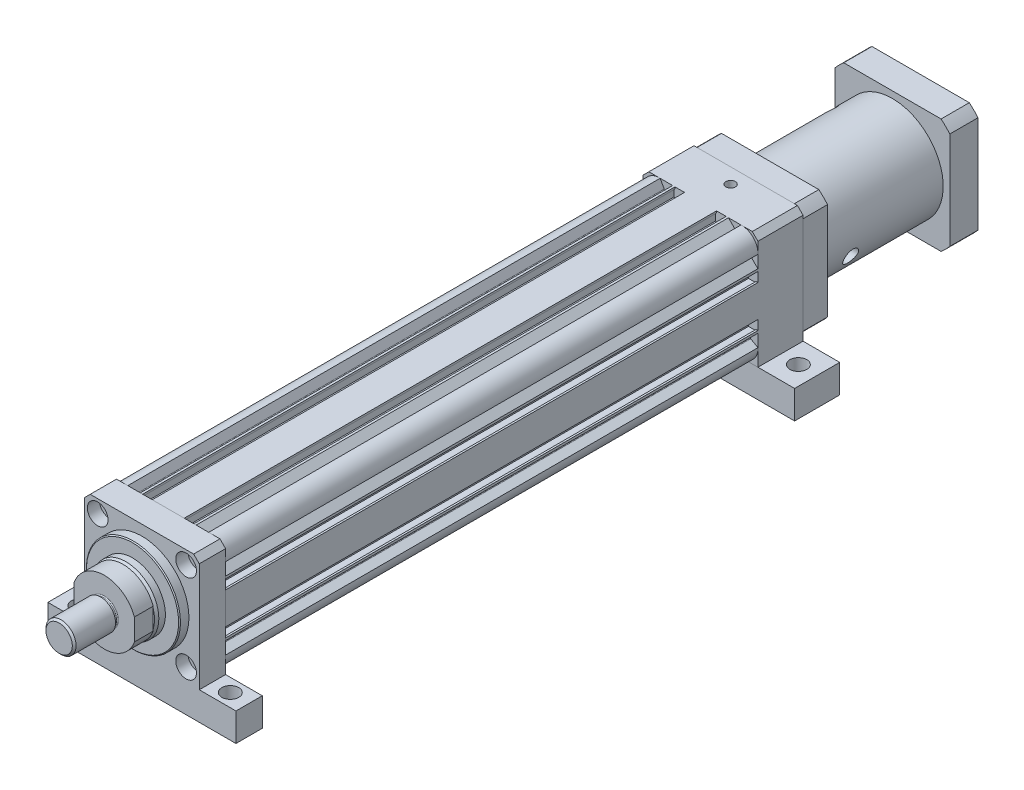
from build123d import *

# Parameters (mm, degrees)
SKETCH_1_R           = 25
SKETCH_1_R_2         = 2.594
EXTRUDE_1_DEPTH      = 283
EXTRUDE_1_2_DEPTH    = 14
SKETCH_3_R           = 4.5
SKETCH_3_R_2         = 3.5
CUT_EXTRUDE_3_DEPTH  = 14
SKETCH_3_5_R         = 5.5
CUT_EXTRUDE_4_DEPTH  = 6.5
SKETCH_5_R           = 25
EXTRUDE_2_DEPTH      = 5
CHAMFER_1_SIZE       = 0.5
SKETCH_6_R           = 17.5
EXTRUDE_3_DEPTH      = 5
CHAMFER_2_SIZE       = 1.5
CHAMFER_2_SIZE2      = 0.8
EXTRUDE_4_DEPTH      = 10
SKETCH_8_R           = 7
EXTRUDE_5_DEPTH      = 2
SKETCH_9_R           = 8
EXTRUDE_6_DEPTH      = 22
CHAMFER_3_SIZE       = 1
FILLET_1_R           = 0.5
SKETCH_10_W          = 61
SKETCH_10_H          = 61
EXTRUDE_7_DEPTH      = 24
SKETCH_16_W          = 61
SKETCH_16_H          = 61
EXTRUDE_8_DEPTH      = 13
SKETCH_18_R          = 3.5
CUT_EXTRUDE_5_DEPTH  = 13
SKETCH_19_R          = 27
EXTRUDE_9_DEPTH      = 65
SKETCH_20_W          = 61
SKETCH_20_H          = 61
EXTRUDE_10_DEPTH     = 15
SKETCH_21_R          = 2.5
CUT_EXTRUDE_6_DEPTH  = 10
SKETCH_22_R          = 50
SKETCH_22_R_2        = 40
CUT_EXTRUDE_2_DEPTH  = 93
SKETCH_23_R          = 21
CUT_EXTRUDE_7_DEPTH  = 80
SKETCH_23_3_R        = 25
CUT_EXTRUDE_8_DEPTH  = 7
SKETCH_24_R          = 4
CUT_EXTRUDE_9_DEPTH  = 27
SKETCH_25_R          = 4
CUT_EXTRUDE_10_DEPTH = 27
SKETCH_26_W          = 100
SKETCH_26_H          = 24
SKETCH_26_R          = 4.5
SKETCH_26_H_2        = 14
EXTRUDE_12_DEPTH     = 15
CHAMFER_4_SIZE       = 3


with BuildPart() as part:
    # Sketch 1 → Extrude 1 (new body)
    with BuildSketch(Plane.XY):
        with BuildLine():
            Line((30.5, 8.5), (29.5, 8.5))
            Line((29.5, 8.5), (29.5, 7.9))
            Line((29.5, 7.9), (25.5, 7.9))
            Line((25.5, 7.9), (25.5, 14.2))
            Line((25.5, 14.2), (29.5, 14.2))
            Line((29.5, 14.2), (29.5, 13.6))
            Line((29.5, 13.6), (30.5, 13.6))
            Line((30.5, 13.6), (30.5, 14.843551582))
            Line((30.5, 14.843551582), (26.602512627, 18.741038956))
            ThreePointArc((26.602512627, 18.741038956), (26.502994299, 19.034210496), (26.675, 19.29163522))
            Line((26.675, 19.29163522), (30.5, 21.5))
            ThreePointArc((30.5, 21.5), (28.010599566, 28.010599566), (21.5, 30.5))
            Line((21.5, 30.5), (19.29163522, 26.675))
            ThreePointArc((19.29163522, 26.675), (19.034210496, 26.502994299), (18.741038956, 26.602512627))
            Line((18.741038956, 26.602512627), (14.843551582, 30.5))
            Line((14.843551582, 30.5), (13.6, 30.5))
            Line((13.6, 30.5), (13.6, 29.5))
            Line((13.6, 29.5), (14.2, 29.5))
            Line((14.2, 29.5), (14.2, 25.5))
            Line((14.2, 25.5), (7.9, 25.5))
            Line((7.9, 25.5), (7.9, 29.5))
            Line((7.9, 29.5), (8.5, 29.5))
            Line((8.5, 29.5), (8.5, 30.5))
            Line((8.5, 30.5), (-8.5, 30.5))
            Line((-8.5, 30.5), (-8.5, 29.5))
            Line((-8.5, 29.5), (-7.9, 29.5))
            Line((-7.9, 29.5), (-7.9, 25.5))
            Line((-7.9, 25.5), (-14.2, 25.5))
            Line((-14.2, 25.5), (-14.2, 29.5))
            Line((-14.2, 29.5), (-13.6, 29.5))
            Line((-13.6, 29.5), (-13.6, 30.5))
            Line((-13.6, 30.5), (-14.843551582, 30.5))
            Line((-14.843551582, 30.5), (-18.741038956, 26.602512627))
            ThreePointArc((-18.741038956, 26.602512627), (-19.034210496, 26.502994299), (-19.29163522, 26.675))
            Line((-19.29163522, 26.675), (-21.5, 30.5))
            ThreePointArc((-21.5, 30.5), (-28.010599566, 28.010599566), (-30.5, 21.5))
            Line((-30.5, 21.5), (-26.675, 19.29163522))
            ThreePointArc((-26.675, 19.29163522), (-26.502994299, 19.034210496), (-26.602512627, 18.741038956))
            Line((-26.602512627, 18.741038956), (-30.5, 14.843551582))
            Line((-30.5, 14.843551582), (-30.5, 13.6))
            Line((-30.5, 13.6), (-29.5, 13.6))
            Line((-29.5, 13.6), (-29.5, 14.2))
            Line((-29.5, 14.2), (-25.5, 14.2))
            Line((-25.5, 14.2), (-25.5, 7.9))
            Line((-25.5, 7.9), (-29.5, 7.9))
            Line((-29.5, 7.9), (-29.5, 8.5))
            Line((-29.5, 8.5), (-30.5, 8.5))
            Line((-30.5, 8.5), (-30.5, -8.5))
            Line((-30.5, -8.5), (-29.5, -8.5))
            Line((-29.5, -8.5), (-29.5, -7.9))
            Line((-29.5, -7.9), (-25.5, -7.9))
            Line((-25.5, -7.9), (-25.5, -14.2))
            Line((-25.5, -14.2), (-29.5, -14.2))
            Line((-29.5, -14.2), (-29.5, -13.6))
            Line((-29.5, -13.6), (-30.5, -13.6))
            Line((-30.5, -13.6), (-30.5, -14.843551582))
            Line((-30.5, -14.843551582), (-26.602512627, -18.741038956))
            ThreePointArc((-26.602512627, -18.741038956), (-26.502994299, -19.034210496), (-26.675, -19.29163522))
            Line((-26.675, -19.29163522), (-30.5, -21.5))
            ThreePointArc((-30.5, -21.5), (-27.825897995, -28.191225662), (-21, -30.5))
            Line((-21, -30.5), (-18.79163522, -26.675))
            ThreePointArc((-18.79163522, -26.675), (-18.534210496, -26.502994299), (-18.241038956, -26.602512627))
            Line((-18.241038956, -26.602512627), (-14.343551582, -30.5))
            Line((-14.343551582, -30.5), (14.343551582, -30.5))
            Line((14.343551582, -30.5), (18.241038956, -26.602512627))
            ThreePointArc((18.241038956, -26.602512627), (18.534210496, -26.502994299), (18.79163522, -26.675))
            Line((18.79163522, -26.675), (21, -30.5))
            ThreePointArc((21, -30.5), (27.825897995, -28.191225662), (30.5, -21.5))
            Line((30.5, -21.5), (26.675, -19.29163522))
            ThreePointArc((26.675, -19.29163522), (26.502994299, -19.034210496), (26.602512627, -18.741038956))
            Line((26.602512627, -18.741038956), (30.5, -14.843551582))
            Line((30.5, -14.843551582), (30.5, -13.6))
            Line((30.5, -13.6), (29.5, -13.6))
            Line((29.5, -13.6), (29.5, -14.2))
            Line((29.5, -14.2), (25.5, -14.2))
            Line((25.5, -14.2), (25.5, -7.9))
            Line((25.5, -7.9), (29.5, -7.9))
            Line((29.5, -7.9), (29.5, -8.5))
            Line((29.5, -8.5), (30.5, -8.5))
            Line((30.5, -8.5), (30.5, 8.5))
        make_face()
        Circle(SKETCH_1_R, mode=Mode.SUBTRACT)
        with Locations((23.5, -23.5)):
            Circle(SKETCH_1_R_2, mode=Mode.SUBTRACT)
        with Locations((-23.5, -23.5)):
            Circle(SKETCH_1_R_2, mode=Mode.SUBTRACT)
        with Locations((23.5, 23.5)):
            Circle(SKETCH_1_R_2, mode=Mode.SUBTRACT)
        with Locations((-23.5, 23.5)):
            Circle(SKETCH_1_R_2, mode=Mode.SUBTRACT)
        with BuildLine():
            Line((-14.843484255, -26.551505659), (-5.699422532, -26.551505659))
            ThreePointArc((-5.699422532, -26.551505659), (-5.401016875, -26.282393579), (-5.637974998, -25.957866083))
            ThreePointArc((-5.637974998, -25.957866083), (-10.496775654, -24.470016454), (-15.006657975, -22.128520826))
            ThreePointArc((-15.006657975, -22.128520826), (-15.31244973, -22.117932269), (-15.468484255, -22.381131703))
            Line((-15.468484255, -22.381131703), (-15.468484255, -25.926505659))
            Line((-15.468484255, -25.926505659), (-14.843484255, -26.551505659))
        make_face(mode=Mode.SUBTRACT)
        with BuildLine():
            Line((15.037740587, -26.551505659), (5.893678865, -26.551505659))
            ThreePointArc((5.893678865, -26.551505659), (5.595273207, -26.282393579), (5.832231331, -25.957866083))
            ThreePointArc((5.832231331, -25.957866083), (10.691031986, -24.470016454), (15.200914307, -22.128520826))
            ThreePointArc((15.200914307, -22.128520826), (15.506706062, -22.117932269), (15.662740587, -22.381131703))
            Line((15.662740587, -22.381131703), (15.662740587, -25.926505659))
            Line((15.662740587, -25.926505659), (15.037740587, -26.551505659))
        make_face(mode=Mode.SUBTRACT)
        with BuildLine():
            Line((24.057261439, -13.884764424), (23.358946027, -13.481591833))
            ThreePointArc((23.358946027, -13.481591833), (23.055418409, -13.441631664), (22.812535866, -13.628001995))
            Line((22.812535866, -13.628001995), (21.480305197, -15.935493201))
            ThreePointArc((21.480305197, -15.935493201), (21.440345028, -16.239020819), (21.626715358, -16.481903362))
            Line((21.626715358, -16.481903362), (22.892186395, -17.212523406))
            ThreePointArc((22.892186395, -17.212523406), (23.195714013, -17.252483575), (23.438596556, -17.066113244))
            Line((23.438596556, -17.066113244), (24.274264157, -15.618694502))
            ThreePointArc((24.274264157, -15.618694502), (24.317966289, -15.507082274), (24.326638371, -15.387533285))
            Line((24.326638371, -15.387533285), (24.223757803, -14.070923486))
            ThreePointArc((24.223757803, -14.070923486), (24.155411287, -13.964516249), (24.057261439, -13.884764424))
        make_face(mode=Mode.SUBTRACT)
        with BuildLine():
            Line((-24.057261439, -13.884764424), (-23.358946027, -13.481591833))
            ThreePointArc((-23.358946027, -13.481591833), (-23.055418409, -13.441631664), (-22.812535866, -13.628001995))
            Line((-22.812535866, -13.628001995), (-21.480305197, -15.935493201))
            ThreePointArc((-21.480305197, -15.935493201), (-21.440345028, -16.239020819), (-21.626715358, -16.481903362))
            Line((-21.626715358, -16.481903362), (-22.892186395, -17.212523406))
            ThreePointArc((-22.892186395, -17.212523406), (-23.195714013, -17.252483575), (-23.438596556, -17.066113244))
            Line((-23.438596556, -17.066113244), (-24.274264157, -15.618694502))
            ThreePointArc((-24.274264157, -15.618694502), (-24.317966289, -15.507082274), (-24.326638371, -15.387533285))
            Line((-24.326638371, -15.387533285), (-24.223757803, -14.070923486))
            ThreePointArc((-24.223757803, -14.070923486), (-24.155411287, -13.964516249), (-24.057261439, -13.884764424))
        make_face(mode=Mode.SUBTRACT)
        with BuildLine():
            Line((24.057261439, 13.884764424), (23.358946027, 13.481591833))
            ThreePointArc((23.358946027, 13.481591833), (23.055418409, 13.441631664), (22.812535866, 13.628001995))
            Line((22.812535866, 13.628001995), (21.480305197, 15.935493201))
            ThreePointArc((21.480305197, 15.935493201), (21.440345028, 16.239020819), (21.626715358, 16.481903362))
            Line((21.626715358, 16.481903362), (22.892186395, 17.212523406))
            ThreePointArc((22.892186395, 17.212523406), (23.195714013, 17.252483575), (23.438596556, 17.066113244))
            Line((23.438596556, 17.066113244), (24.274264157, 15.618694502))
            ThreePointArc((24.274264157, 15.618694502), (24.317966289, 15.507082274), (24.326638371, 15.387533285))
            Line((24.326638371, 15.387533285), (24.223757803, 14.070923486))
            ThreePointArc((24.223757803, 14.070923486), (24.155411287, 13.964516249), (24.057261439, 13.884764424))
        make_face(mode=Mode.SUBTRACT)
        with BuildLine():
            Line((-24.057261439, 13.884764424), (-23.358946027, 13.481591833))
            ThreePointArc((-23.358946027, 13.481591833), (-23.055418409, 13.441631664), (-22.812535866, 13.628001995))
            Line((-22.812535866, 13.628001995), (-21.480305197, 15.935493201))
            ThreePointArc((-21.480305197, 15.935493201), (-21.440345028, 16.239020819), (-21.626715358, 16.481903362))
            Line((-21.626715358, 16.481903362), (-22.892186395, 17.212523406))
            ThreePointArc((-22.892186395, 17.212523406), (-23.195714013, 17.252483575), (-23.438596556, 17.066113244))
            Line((-23.438596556, 17.066113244), (-24.274264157, 15.618694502))
            ThreePointArc((-24.274264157, 15.618694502), (-24.317966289, 15.507082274), (-24.326638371, 15.387533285))
            Line((-24.326638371, 15.387533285), (-24.223757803, 14.070923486))
            ThreePointArc((-24.223757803, 14.070923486), (-24.155411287, 13.964516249), (-24.057261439, 13.884764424))
        make_face(mode=Mode.SUBTRACT)
        with BuildLine():
            Line((17.761634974, 23.75411276), (17.07315308, 24.68624059))
            ThreePointArc((17.07315308, 24.68624059), (16.934629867, 24.812286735), (16.758415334, 24.87572765))
            Line((16.758415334, 24.87572765), (13.966108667, 25.295529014))
            ThreePointArc((13.966108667, 25.295529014), (13.689318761, 25.25468305), (13.482325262, 25.066441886))
            Line((13.482325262, 25.066441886), (12.839111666, 23.986237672))
            ThreePointArc((12.839111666, 23.986237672), (12.785382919, 23.626185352), (12.999780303, 23.331977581))
            ThreePointArc((12.999780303, 23.331977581), (14.833000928, 22.112125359), (16.576342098, 20.766949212))
            ThreePointArc((16.576342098, 20.766949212), (17.053890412, 20.688035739), (17.357364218, 21.065107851))
            Line((17.357364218, 21.065107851), (17.761634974, 23.75411276))
        make_face(mode=Mode.SUBTRACT)
        with BuildLine():
            Line((-17.761634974, 23.75411276), (-17.07315308, 24.68624059))
            ThreePointArc((-17.07315308, 24.68624059), (-16.934629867, 24.812286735), (-16.758415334, 24.87572765))
            Line((-16.758415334, 24.87572765), (-13.966108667, 25.295529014))
            ThreePointArc((-13.966108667, 25.295529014), (-13.689318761, 25.25468305), (-13.482325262, 25.066441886))
            Line((-13.482325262, 25.066441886), (-12.839111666, 23.986237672))
            ThreePointArc((-12.839111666, 23.986237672), (-12.785382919, 23.626185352), (-12.999780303, 23.331977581))
            ThreePointArc((-12.999780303, 23.331977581), (-14.833000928, 22.112125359), (-16.576342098, 20.766949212))
            ThreePointArc((-16.576342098, 20.766949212), (-17.053890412, 20.688035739), (-17.357364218, 21.065107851))
            Line((-17.357364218, 21.065107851), (-17.761634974, 23.75411276))
        make_face(mode=Mode.SUBTRACT)
    extrude(amount=EXTRUDE_1_DEPTH)

    # Sketch 10 → Extrude 7 (add)
    with BuildSketch(Plane(origin=(0, 0, 0), x_dir=(-1, 0, 0), z_dir=(0, 0, -1))):
        Rectangle(SKETCH_10_W, SKETCH_10_H)
    extrude(amount=EXTRUDE_7_DEPTH)

    # Sketch 15 → Hole Wizard M6 _1 (revolve, cut)
    with BuildSketch(Plane(origin=(0, 30.5, -16), x_dir=(0, 0, 1), z_dir=(1, 0, 0))):
        Polygon((0, 0), (0, 9.502151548), (2.5, 8), (2.5, 0), align=None)
    revolve(axis=Axis((0, 36.85, -16), (0, -1, 0)), mode=Mode.SUBTRACT)

    # Chamfer 4
    chamfer_4_edges = [part.edges().sort_by_distance(p)[0] for p in [
        (-30.5, 30.5, -12),
        (30.5, 30.5, -12),
    ]]
    chamfer(chamfer_4_edges, length=CHAMFER_4_SIZE)


with BuildPart() as body_2:
    # Sketch 2 → Extrude 1 2 (new body)
    with BuildSketch(Plane.XY.offset(283)):
        Polygon((-27.5, 30.5), (-30.5, 27.5), (-30.5, -27.5), (-30.5, -30.5), (-27.5, -30.5), (27.5, -30.5), (30.5, -30.5), (30.5, -27.5), (30.5, 27.5), (27.5, 30.5), align=None)
    extrude(amount=EXTRUDE_1_2_DEPTH)

    # Sketch 3 → Cut-Extrude 3 (cut)
    with BuildSketch(Plane.XY.offset(297)):
        with Locations((-40, -20)):
            Circle(SKETCH_3_R)
        with Locations((-23.5, -23.5)):
            Circle(SKETCH_3_R_2)
        with Locations((-23.5, 23.5)):
            Circle(SKETCH_3_R_2)
        with Locations((23.5, 23.5)):
            Circle(SKETCH_3_R_2)
        with Locations((40, 20)):
            Circle(SKETCH_3_R)
        with Locations((40, -20)):
            Circle(SKETCH_3_R)
        with Locations((23.5, -23.5)):
            Circle(SKETCH_3_R_2)
        with Locations((-40, 20)):
            Circle(SKETCH_3_R)
    extrude(amount=-CUT_EXTRUDE_3_DEPTH, mode=Mode.SUBTRACT)

    # Sketch 3_5 → Cut-Extrude 4 (cut)
    with BuildSketch(Plane.XY.offset(297)):
        with Locations((-23.5, 23.5)):
            Circle(SKETCH_3_5_R)
        with Locations((-23.5, -23.5)):
            Circle(SKETCH_3_5_R)
        with Locations((23.5, -23.5)):
            Circle(SKETCH_3_5_R)
        with Locations((23.5, 23.5)):
            Circle(SKETCH_3_5_R)
    extrude(amount=-CUT_EXTRUDE_4_DEPTH, mode=Mode.SUBTRACT)

    # Sketch 5 → Extrude 2 (add)
    with BuildSketch(Plane.XY.offset(297)):
        Circle(SKETCH_5_R)
    extrude(amount=EXTRUDE_2_DEPTH)

    # Chamfer 1
    chamfer_1_edges = [body_2.edges().sort_by_distance(p)[0] for p in [
        (-25, 0, 302),
    ]]
    chamfer(chamfer_1_edges, length=CHAMFER_1_SIZE)

    # Sketch 6 → Extrude 3 (add)
    with BuildSketch(Plane.XY.offset(302)):
        Circle(SKETCH_6_R)
    extrude(amount=EXTRUDE_3_DEPTH)

    # Chamfer 2
    chamfer_2_edges = [body_2.edges().sort_by_distance(p)[0] for p in [
        (-17.5, 0, 307),
    ]]
    chamfer_2_side = [body_2.faces().sort_by_distance(p)[0] for p in [
        (-17.5, 0, 304.5),
    ]]
    chamfer(chamfer_2_edges, length=CHAMFER_2_SIZE, length2=CHAMFER_2_SIZE2, reference=chamfer_2_side[0])

    # Sketch 7 → Extrude 4 (add)
    with BuildSketch(Plane.XY.offset(307)):
        with BuildLine():
            Line((-16, 5.744562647), (-16, -5.744562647))
            ThreePointArc((-16, -5.744562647), (0, -17), (16, -5.744562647))
            Line((16, -5.744562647), (16, 5.744562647))
            ThreePointArc((16, 5.744562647), (0, 17), (-16, 5.744562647))
        make_face()
    extrude(amount=EXTRUDE_4_DEPTH)

    # Sketch 8 → Extrude 5 (add)
    with BuildSketch(Plane.XY.offset(317)):
        Circle(SKETCH_8_R)
    extrude(amount=EXTRUDE_5_DEPTH)

    # Sketch 9 → Extrude 6 (add)
    with BuildSketch(Plane.XY.offset(319)):
        Circle(SKETCH_9_R)
    extrude(amount=EXTRUDE_6_DEPTH)

    # Chamfer 3
    chamfer_3_edges = [body_2.edges().sort_by_distance(p)[0] for p in [
        (-8, 0, 341),
    ]]
    chamfer(chamfer_3_edges, length=CHAMFER_3_SIZE)

    # Fillet 1
    fillet_1_edges = [body_2.edges().sort_by_distance(p)[0] for p in [
        (-7, 0, 317),
    ]]
    fillet(fillet_1_edges, radius=FILLET_1_R)

    # Sketch 26 → Extrude 12 (add)
    # profile 1 of 2: a face of its own
    with BuildSketch(Plane.XZ.offset(30.5)):
        with Locations((0, -12)):
            Rectangle(SKETCH_26_W, SKETCH_26_H)
        with Locations(Location((-40, -12, 0), (0, 0, 270))):
            Circle(SKETCH_26_R, mode=Mode.SUBTRACT)
        with Locations(Location((40, -12, 0), (0, 0, 270))):
            Circle(SKETCH_26_R, mode=Mode.SUBTRACT)
    # profile 2 of 2: a face of its own
    with BuildSketch(Plane.XZ.offset(30.5)):
        with Locations((-0.005817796, 290)):
            Rectangle(SKETCH_26_W, SKETCH_26_H_2)
        with Locations(Location((39.994182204, 290, 0), (0, 0, 270))):
            Circle(SKETCH_26_R, mode=Mode.SUBTRACT)
        with Locations(Location((-40.005817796, 290, 0), (0, 0, 270))):
            Circle(SKETCH_26_R, mode=Mode.SUBTRACT)
    extrude(amount=EXTRUDE_12_DEPTH)


with BuildPart() as body_3:
    # Sketch 16 → Extrude 8 (new body)
    with BuildSketch(Plane(origin=(0, 0, -24), x_dir=(-1, 0, 0), z_dir=(0, 0, -1))):
        Rectangle(SKETCH_16_W, SKETCH_16_H)
    extrude(amount=EXTRUDE_8_DEPTH)

    # Sketch 18 → Cut-Extrude 5 (cut)
    with BuildSketch(Plane(origin=(0, 0, -37), x_dir=(-1, 0, 0), z_dir=(0, 0, -1))):
        with Locations((-23.5, 23.5)):
            Circle(SKETCH_18_R)
        with Locations((-23.5, -23.5)):
            Circle(SKETCH_18_R)
        with Locations((23.5, -23.5)):
            Circle(SKETCH_18_R)
        with Locations((23.5, 23.5)):
            Circle(SKETCH_18_R)
    extrude(amount=-CUT_EXTRUDE_5_DEPTH, mode=Mode.SUBTRACT)

    # Sketch 19 → Extrude 9 (add)
    with BuildSketch(Plane(origin=(0, 0, -37), x_dir=(-1, 0, 0), z_dir=(0, 0, -1))):
        Circle(SKETCH_19_R)
    extrude(amount=EXTRUDE_9_DEPTH)

    # Sketch 20 → Extrude 10 (add)
    with BuildSketch(Plane(origin=(0, 0, -102), x_dir=(-1, 0, 0), z_dir=(0, 0, -1))):
        Rectangle(SKETCH_20_W, SKETCH_20_H)
    extrude(amount=EXTRUDE_10_DEPTH)

    # Sketch 21 → Cut-Extrude 6 (cut)
    with BuildSketch(Plane(origin=(0, 0, -117), x_dir=(-1, 0, 0), z_dir=(0, 0, -1))):
        with Locations((-24.748737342, 24.748737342)):
            Circle(SKETCH_21_R)
        with Locations((24.748737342, 24.748737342)):
            Circle(SKETCH_21_R)
        with Locations((24.748737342, -24.748737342)):
            Circle(SKETCH_21_R)
        with Locations((-24.748737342, -24.748737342)):
            Circle(SKETCH_21_R)
    extrude(amount=-CUT_EXTRUDE_6_DEPTH, mode=Mode.SUBTRACT)

    # Sketch 22 → Cut-Extrude 2 (cut)
    with BuildSketch(Plane(origin=(0, 0, -117), x_dir=(-1, 0, 0), z_dir=(0, 0, -1))):
        Circle(SKETCH_22_R)
        Circle(SKETCH_22_R_2, mode=Mode.SUBTRACT)
    extrude(amount=-CUT_EXTRUDE_2_DEPTH, mode=Mode.SUBTRACT)

    # Sketch 23 → Cut-Extrude 7 (cut)
    with BuildSketch(Plane(origin=(0, 0, -117), x_dir=(-1, 0, 0), z_dir=(0, 0, -1))):
        Circle(SKETCH_23_R)
    extrude(amount=-CUT_EXTRUDE_7_DEPTH, mode=Mode.SUBTRACT)

    # Sketch 23_3 → Cut-Extrude 8 (cut)
    with BuildSketch(Plane(origin=(0, 0, -117), x_dir=(-1, 0, 0), z_dir=(0, 0, -1))):
        Circle(SKETCH_23_3_R)
    extrude(amount=-CUT_EXTRUDE_8_DEPTH, mode=Mode.SUBTRACT)

    # Sketch 24 → Cut-Extrude 9 (cut)
    with BuildSketch(Plane.ZY.offset(30.5)):
        with Locations(Location((-88.78323725, 17.446251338, 0), (0, 0, 270))):
            Circle(SKETCH_24_R)
    extrude(amount=-CUT_EXTRUDE_9_DEPTH, mode=Mode.SUBTRACT)

    # Sketch 25 → Cut-Extrude 10 (cut)
    with BuildSketch(Plane(origin=(30.5, 0, 0), x_dir=(0, 0, -1), z_dir=(1, 0, 0))):
        with Locations((54.542092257, -9.414024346)):
            Circle(SKETCH_25_R)
    extrude(amount=-CUT_EXTRUDE_10_DEPTH, mode=Mode.SUBTRACT)


with BuildPart() as extrude_12_piece_1:
    # of the separate pieces the step leaves, piece 1, a body of its own (extrude_12_pieces)
    add(body_2.part.solids().sort_by_distance((-50.005817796, -30.5, 283))[0])


with BuildPart() as extrude_12_piece_2:
    # of the separate pieces the step leaves, piece 2, a body of its own (extrude_12_pieces)
    add(body_2.part.solids().sort_by_distance((-50, -30.5, -24))[0])


solid = Compound([part.part, body_3.part, extrude_12_piece_1.part, extrude_12_piece_2.part])
